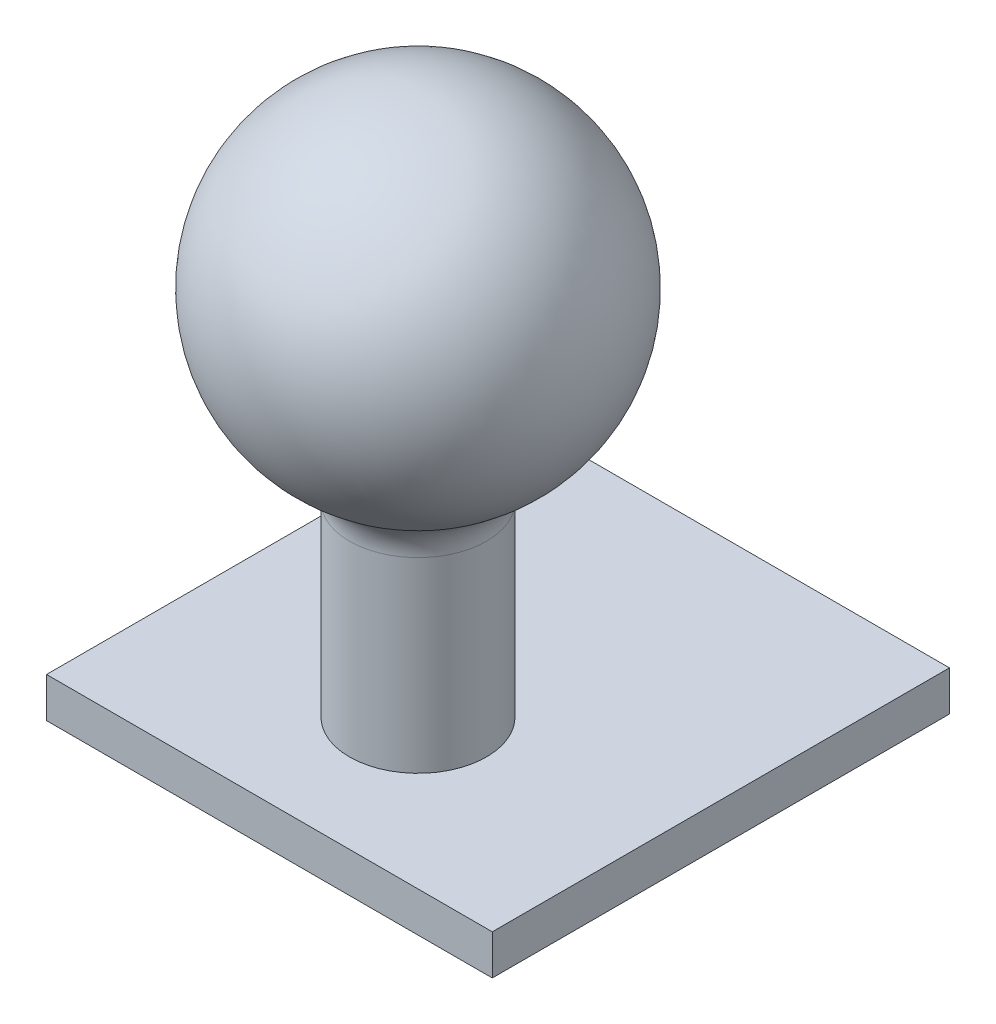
ISO-10303-21;
HEADER;
FILE_DESCRIPTION(('STEP AP214'),'2;1');
FILE_NAME('part.step','',(''),(''),'','','');
FILE_SCHEMA(('AUTOMOTIVE_DESIGN { 1 0 10303 214 1 1 1 1 }'));
ENDSEC;
DATA;
#1=APPLICATION_CONTEXT('core data for automotive mechanical design processes');
#2=APPLICATION_PROTOCOL_DEFINITION('international standard','automotive_design',2000,#1);
#3=PRODUCT_CONTEXT('',#1,'mechanical');
#4=PRODUCT('Part','Part','',(#3));
#5=PRODUCT_RELATED_PRODUCT_CATEGORY('part','',(#4));
#6=PRODUCT_DEFINITION_FORMATION('','',#4);
#7=PRODUCT_DEFINITION_CONTEXT('part definition',#1,'design');
#8=PRODUCT_DEFINITION('design','',#6,#7);
#9=PRODUCT_DEFINITION_SHAPE('','',#8);
#10=(LENGTH_UNIT() NAMED_UNIT(*) SI_UNIT(.MILLI.,.METRE.));
#11=(NAMED_UNIT(*) PLANE_ANGLE_UNIT() SI_UNIT($,.RADIAN.));
#12=(NAMED_UNIT(*) SI_UNIT($,.STERADIAN.) SOLID_ANGLE_UNIT());
#13=UNCERTAINTY_MEASURE_WITH_UNIT(LENGTH_MEASURE(1.E-05),#10,'distance_accuracy_value','');
#14=(GEOMETRIC_REPRESENTATION_CONTEXT(3) GLOBAL_UNCERTAINTY_ASSIGNED_CONTEXT((#13)) GLOBAL_UNIT_ASSIGNED_CONTEXT((#10,
#11,#12)) REPRESENTATION_CONTEXT('',''));
#15=CARTESIAN_POINT('',(0.,0.,0.));
#16=DIRECTION('',(0.,0.,1.));
#17=DIRECTION('',(1.,0.,0.));
#18=AXIS2_PLACEMENT_3D('',#15,#16,#17);
#19=CARTESIAN_POINT('',(0.,0.,0.));
#20=DIRECTION('',(0.,1.,0.));
#21=DIRECTION('',(0.,0.,-1.));
#22=AXIS2_PLACEMENT_3D('',#19,#20,#21);
#23=SPHERICAL_SURFACE('',#22,7.5);
#24=CARTESIAN_POINT('',(0.,-6.37716885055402,0.));
#25=DIRECTION('',(0.,1.,0.));
#26=DIRECTION('',(0.,0.,1.));
#27=AXIS2_PLACEMENT_3D('',#24,#25,#26);
#28=CIRCLE('',#27,3.94736842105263);
#29=CARTESIAN_POINT('',(0.,-6.37716885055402,3.94736842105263));
#30=VERTEX_POINT('',#29);
#31=EDGE_CURVE('E49',#30,#30,#28,.T.);
#32=ORIENTED_EDGE('',*,*,#31,.T.);
#33=EDGE_LOOP('',(#32));
#34=FACE_BOUND('',#33,.T.);
#35=ADVANCED_FACE('F41',(#34),#23,.T.);
#36=CARTESIAN_POINT('',(0.,-16.25,-3.));
#37=DIRECTION('',(0.,-1.,0.));
#38=DIRECTION('',(0.,0.,-1.));
#39=AXIS2_PLACEMENT_3D('',#36,#37,#38);
#40=PLANE('',#39);
#41=CARTESIAN_POINT('',(0.,-16.25,0.));
#42=DIRECTION('',(0.,1.,0.));
#43=DIRECTION('',(0.,0.,1.));
#44=AXIS2_PLACEMENT_3D('',#41,#42,#43);
#45=CIRCLE('',#44,3.);
#46=CARTESIAN_POINT('',(0.,-16.25,3.));
#47=VERTEX_POINT('',#46);
#48=EDGE_CURVE('E119',#47,#47,#45,.T.);
#49=ORIENTED_EDGE('',*,*,#48,.F.);
#50=EDGE_LOOP('',(#49));
#51=FACE_BOUND('',#50,.T.);
#52=DIRECTION('',(0.,0.,1.));
#53=VECTOR('',#52,1.);
#54=CARTESIAN_POINT('',(-9.75,-16.25,-10.));
#55=LINE('',#54,#53);
#56=CARTESIAN_POINT('',(-9.75,-16.25,-13.5));
#57=VERTEX_POINT('',#56);
#58=CARTESIAN_POINT('',(-9.75,-16.25,6.5));
#59=VERTEX_POINT('',#58);
#60=EDGE_CURVE('E92',#57,#59,#55,.T.);
#61=ORIENTED_EDGE('',*,*,#60,.T.);
#62=DIRECTION('',(-1.,0.,0.));
#63=VECTOR('',#62,1.);
#64=CARTESIAN_POINT('',(-9.75,-16.25,6.5));
#65=LINE('',#64,#63);
#66=CARTESIAN_POINT('',(9.75,-16.25,6.5));
#67=VERTEX_POINT('',#66);
#68=EDGE_CURVE('E113',#67,#59,#65,.T.);
#69=ORIENTED_EDGE('',*,*,#68,.F.);
#70=DIRECTION('',(0.,0.,-1.));
#71=VECTOR('',#70,1.);
#72=CARTESIAN_POINT('',(9.75,-16.25,-10.));
#73=LINE('',#72,#71);
#74=CARTESIAN_POINT('',(9.75,-16.25,-13.5));
#75=VERTEX_POINT('',#74);
#76=EDGE_CURVE('E98',#67,#75,#73,.T.);
#77=ORIENTED_EDGE('',*,*,#76,.T.);
#78=DIRECTION('',(1.,0.,0.));
#79=VECTOR('',#78,1.);
#80=CARTESIAN_POINT('',(-9.75,-16.25,-13.5));
#81=LINE('',#80,#79);
#82=EDGE_CURVE('E101',#57,#75,#81,.T.);
#83=ORIENTED_EDGE('',*,*,#82,.F.);
#84=EDGE_LOOP('',(#61,#69,#77,#83));
#85=FACE_BOUND('',#84,.T.);
#86=ADVANCED_FACE('F102',(#51,#85),#40,.F.);
#87=CARTESIAN_POINT('',(0.,0.,0.));
#88=DIRECTION('',(0.,1.,0.));
#89=DIRECTION('',(0.,0.,1.));
#90=AXIS2_PLACEMENT_3D('',#87,#88,#89);
#91=CYLINDRICAL_SURFACE('',#90,3.);
#92=CARTESIAN_POINT('',(0.,-8.07774721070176,0.));
#93=DIRECTION('',(0.,1.,0.));
#94=DIRECTION('',(0.,0.,1.));
#95=AXIS2_PLACEMENT_3D('',#92,#93,#94);
#96=CIRCLE('',#95,3.);
#97=CARTESIAN_POINT('',(0.,-8.07774721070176,3.));
#98=VERTEX_POINT('',#97);
#99=EDGE_CURVE('E11',#98,#98,#96,.F.);
#100=ORIENTED_EDGE('',*,*,#99,.T.);
#101=EDGE_LOOP('',(#100));
#102=FACE_BOUND('',#101,.T.);
#103=ORIENTED_EDGE('',*,*,#48,.T.);
#104=EDGE_LOOP('',(#103));
#105=FACE_BOUND('',#104,.T.);
#106=ADVANCED_FACE('F140',(#102,#105),#91,.T.);
#107=CARTESIAN_POINT('',(9.75,11.6829554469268,-10.));
#108=DIRECTION('',(1.,0.,0.));
#109=DIRECTION('',(0.,0.,-1.));
#110=AXIS2_PLACEMENT_3D('',#107,#108,#109);
#111=PLANE('',#110);
#112=DIRECTION('',(0.,1.,0.));
#113=VECTOR('',#112,1.);
#114=CARTESIAN_POINT('',(9.75,-18.,6.5));
#115=LINE('',#114,#113);
#116=CARTESIAN_POINT('',(9.75,-18.,6.5));
#117=VERTEX_POINT('',#116);
#118=EDGE_CURVE('E68',#117,#67,#115,.T.);
#119=ORIENTED_EDGE('',*,*,#118,.F.);
#120=DIRECTION('',(0.,0.,1.));
#121=VECTOR('',#120,1.);
#122=CARTESIAN_POINT('',(9.75,-18.,-10.));
#123=LINE('',#122,#121);
#124=CARTESIAN_POINT('',(9.75,-18.,-13.5));
#125=VERTEX_POINT('',#124);
#126=EDGE_CURVE('E82',#125,#117,#123,.T.);
#127=ORIENTED_EDGE('',*,*,#126,.F.);
#128=DIRECTION('',(0.,-1.,0.));
#129=VECTOR('',#128,1.);
#130=CARTESIAN_POINT('',(9.75,-16.25,-13.5));
#131=LINE('',#130,#129);
#132=EDGE_CURVE('E105',#75,#125,#131,.T.);
#133=ORIENTED_EDGE('',*,*,#132,.F.);
#134=ORIENTED_EDGE('',*,*,#76,.F.);
#135=EDGE_LOOP('',(#119,#127,#133,#134));
#136=FACE_BOUND('',#135,.T.);
#137=ADVANCED_FACE('F148',(#136),#111,.T.);
#138=CARTESIAN_POINT('',(-9.75,11.6829554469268,-10.));
#139=DIRECTION('',(-1.,0.,0.));
#140=DIRECTION('',(0.,0.,1.));
#141=AXIS2_PLACEMENT_3D('',#138,#139,#140);
#142=PLANE('',#141);
#143=DIRECTION('',(0.,1.,0.));
#144=VECTOR('',#143,1.);
#145=CARTESIAN_POINT('',(-9.75,-18.,6.5));
#146=LINE('',#145,#144);
#147=CARTESIAN_POINT('',(-9.75,-18.,6.5));
#148=VERTEX_POINT('',#147);
#149=EDGE_CURVE('E56',#148,#59,#146,.T.);
#150=ORIENTED_EDGE('',*,*,#149,.T.);
#151=ORIENTED_EDGE('',*,*,#60,.F.);
#152=DIRECTION('',(0.,1.,0.));
#153=VECTOR('',#152,1.);
#154=CARTESIAN_POINT('',(-9.75,-18.,-13.5));
#155=LINE('',#154,#153);
#156=CARTESIAN_POINT('',(-9.75,-18.,-13.5));
#157=VERTEX_POINT('',#156);
#158=EDGE_CURVE('E96',#157,#57,#155,.T.);
#159=ORIENTED_EDGE('',*,*,#158,.F.);
#160=DIRECTION('',(0.,0.,-1.));
#161=VECTOR('',#160,1.);
#162=CARTESIAN_POINT('',(-9.75,-18.,-10.));
#163=LINE('',#162,#161);
#164=EDGE_CURVE('E75',#148,#157,#163,.T.);
#165=ORIENTED_EDGE('',*,*,#164,.F.);
#166=EDGE_LOOP('',(#150,#151,#159,#165));
#167=FACE_BOUND('',#166,.T.);
#168=ADVANCED_FACE('F94',(#167),#142,.T.);
#169=CARTESIAN_POINT('',(0.,-18.,-6.));
#170=DIRECTION('',(0.,1.,0.));
#171=DIRECTION('',(0.,0.,1.));
#172=AXIS2_PLACEMENT_3D('',#169,#170,#171);
#173=PLANE('',#172);
#174=ORIENTED_EDGE('',*,*,#126,.T.);
#175=DIRECTION('',(-1.,0.,0.));
#176=VECTOR('',#175,1.);
#177=CARTESIAN_POINT('',(-9.75,-18.,6.5));
#178=LINE('',#177,#176);
#179=EDGE_CURVE('E61',#117,#148,#178,.T.);
#180=ORIENTED_EDGE('',*,*,#179,.T.);
#181=ORIENTED_EDGE('',*,*,#164,.T.);
#182=DIRECTION('',(-1.,0.,0.));
#183=VECTOR('',#182,1.);
#184=CARTESIAN_POINT('',(9.75,-18.,-13.5));
#185=LINE('',#184,#183);
#186=EDGE_CURVE('E108',#125,#157,#185,.T.);
#187=ORIENTED_EDGE('',*,*,#186,.F.);
#188=EDGE_LOOP('',(#174,#180,#181,#187));
#189=FACE_BOUND('',#188,.T.);
#190=ADVANCED_FACE('F144',(#189),#173,.F.);
#191=CARTESIAN_POINT('',(-9.75,-18.,6.5));
#192=DIRECTION('',(0.,0.,-1.));
#193=DIRECTION('',(0.,1.,0.));
#194=AXIS2_PLACEMENT_3D('',#191,#192,#193);
#195=PLANE('',#194);
#196=ORIENTED_EDGE('',*,*,#68,.T.);
#197=ORIENTED_EDGE('',*,*,#149,.F.);
#198=ORIENTED_EDGE('',*,*,#179,.F.);
#199=ORIENTED_EDGE('',*,*,#118,.T.);
#200=EDGE_LOOP('',(#196,#197,#198,#199));
#201=FACE_BOUND('',#200,.T.);
#202=ADVANCED_FACE('F133',(#201),#195,.F.);
#203=CARTESIAN_POINT('',(0.,0.,-13.5));
#204=DIRECTION('',(0.,0.,-1.));
#205=DIRECTION('',(-1.,0.,0.));
#206=AXIS2_PLACEMENT_3D('',#203,#204,#205);
#207=PLANE('',#206);
#208=ORIENTED_EDGE('',*,*,#158,.T.);
#209=ORIENTED_EDGE('',*,*,#82,.T.);
#210=ORIENTED_EDGE('',*,*,#132,.T.);
#211=ORIENTED_EDGE('',*,*,#186,.T.);
#212=EDGE_LOOP('',(#208,#209,#210,#211));
#213=FACE_BOUND('',#212,.T.);
#214=ADVANCED_FACE('F107',(#213),#207,.T.);
#215=CARTESIAN_POINT('',(0.,-8.07774721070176,0.));
#216=DIRECTION('',(0.,1.,0.));
#217=DIRECTION('',(0.,0.,1.));
#218=AXIS2_PLACEMENT_3D('',#215,#216,#217);
#219=TOROIDAL_SURFACE('',#218,5.,2.);
#220=ORIENTED_EDGE('',*,*,#99,.F.);
#221=EDGE_LOOP('',(#220));
#222=FACE_BOUND('',#221,.T.);
#223=ORIENTED_EDGE('',*,*,#31,.F.);
#224=EDGE_LOOP('',(#223));
#225=FACE_BOUND('',#224,.T.);
#226=ADVANCED_FACE('F43',(#222,#225),#219,.F.);
#227=CLOSED_SHELL('',(#35,#86,#106,#137,#168,#190,#202,#214,#226));
#228=MANIFOLD_SOLID_BREP('B2',#227);
#229=ADVANCED_BREP_SHAPE_REPRESENTATION('',(#18,#228),#14);
#230=SHAPE_DEFINITION_REPRESENTATION(#9,#229);
ENDSEC;
END-ISO-10303-21;
